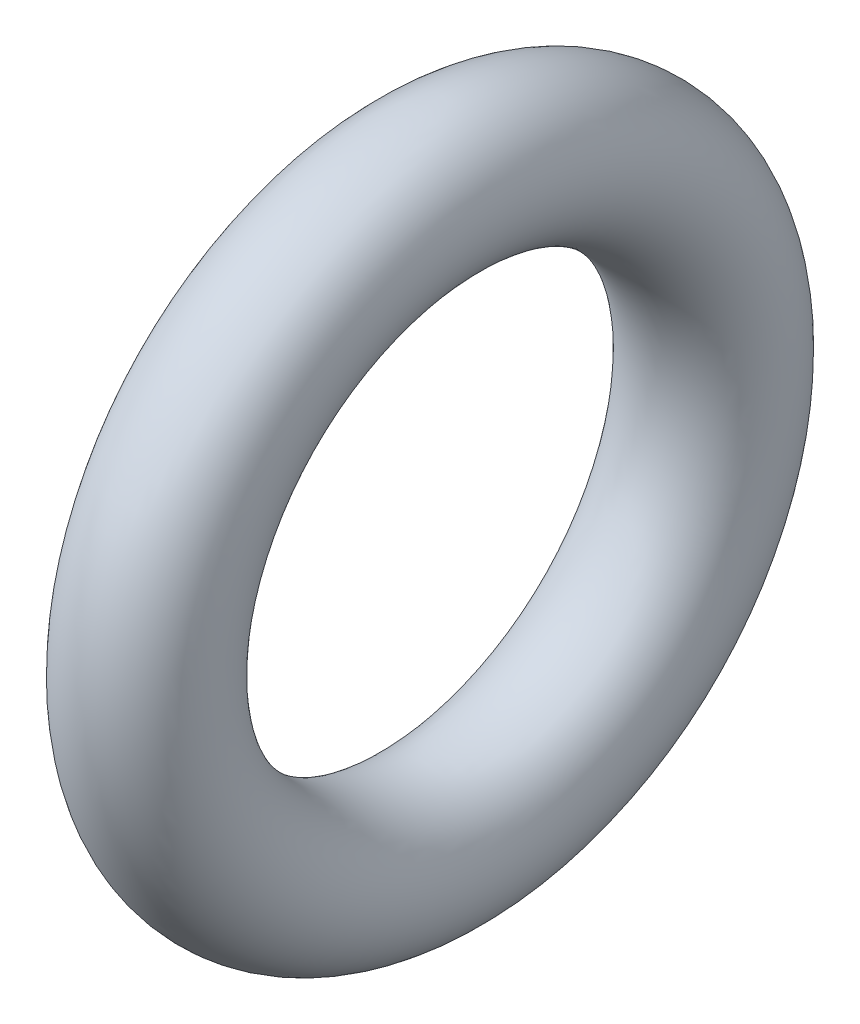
from build123d import *

# Parameters (mm, degrees)
SKETCH1_R = 0.79375


with BuildPart() as part:
    # Sketch1 → Revolve3 (revolve)
    with BuildSketch(Plane.XY, mode=Mode.PRIVATE) as revolve3_sk:
        with Locations((0, 3.175)):
            Circle(SKETCH1_R)
    revolve(revolve3_sk.sketch.rotate(Axis((0, 0, 0), (1, 0, 0)), 90), axis=Axis((0, 0, 0), (1, 0, 0)))


solid = part.part
